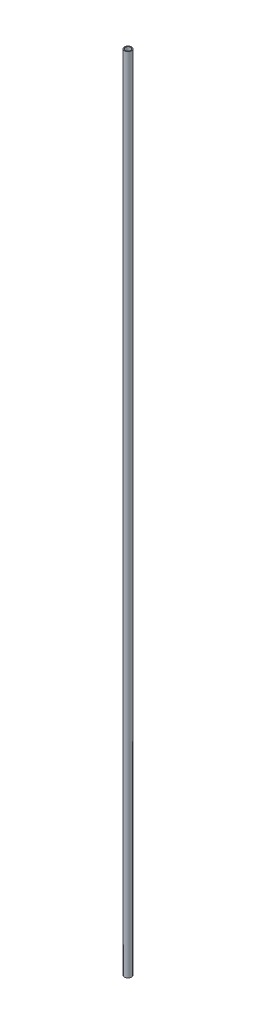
ISO-10303-21;
HEADER;
FILE_DESCRIPTION(('STEP AP214'),'2;1');
FILE_NAME('part.step','',(''),(''),'','','');
FILE_SCHEMA(('AUTOMOTIVE_DESIGN { 1 0 10303 214 1 1 1 1 }'));
ENDSEC;
DATA;
#1=APPLICATION_CONTEXT('core data for automotive mechanical design processes');
#2=APPLICATION_PROTOCOL_DEFINITION('international standard','automotive_design',2000,#1);
#3=PRODUCT_CONTEXT('',#1,'mechanical');
#4=PRODUCT('Part','Part','',(#3));
#5=PRODUCT_RELATED_PRODUCT_CATEGORY('part','',(#4));
#6=PRODUCT_DEFINITION_FORMATION('','',#4);
#7=PRODUCT_DEFINITION_CONTEXT('part definition',#1,'design');
#8=PRODUCT_DEFINITION('design','',#6,#7);
#9=PRODUCT_DEFINITION_SHAPE('','',#8);
#10=(LENGTH_UNIT() NAMED_UNIT(*) SI_UNIT(.MILLI.,.METRE.));
#11=(NAMED_UNIT(*) PLANE_ANGLE_UNIT() SI_UNIT($,.RADIAN.));
#12=(NAMED_UNIT(*) SI_UNIT($,.STERADIAN.) SOLID_ANGLE_UNIT());
#13=UNCERTAINTY_MEASURE_WITH_UNIT(LENGTH_MEASURE(1.E-05),#10,'distance_accuracy_value','');
#14=(GEOMETRIC_REPRESENTATION_CONTEXT(3) GLOBAL_UNCERTAINTY_ASSIGNED_CONTEXT((#13)) GLOBAL_UNIT_ASSIGNED_CONTEXT((#10,
#11,#12)) REPRESENTATION_CONTEXT('',''));
#15=CARTESIAN_POINT('',(0.,0.,0.));
#16=DIRECTION('',(0.,0.,1.));
#17=DIRECTION('',(1.,0.,0.));
#18=AXIS2_PLACEMENT_3D('',#15,#16,#17);
#19=CARTESIAN_POINT('',(0.,3048.,0.));
#20=DIRECTION('',(0.,1.,0.));
#21=DIRECTION('',(0.,0.,1.));
#22=AXIS2_PLACEMENT_3D('',#19,#20,#21);
#23=PLANE('',#22);
#24=CARTESIAN_POINT('',(0.,3048.,0.));
#25=DIRECTION('',(0.,1.,0.));
#26=DIRECTION('',(0.,0.,1.));
#27=AXIS2_PLACEMENT_3D('',#24,#25,#26);
#28=CIRCLE('',#27,13.335);
#29=CARTESIAN_POINT('',(0.,3048.,13.335));
#30=VERTEX_POINT('',#29);
#31=EDGE_CURVE('E10',#30,#30,#28,.T.);
#32=ORIENTED_EDGE('',*,*,#31,.T.);
#33=EDGE_LOOP('',(#32));
#34=FACE_BOUND('',#33,.T.);
#35=CARTESIAN_POINT('',(0.,3048.,0.));
#36=DIRECTION('',(0.,1.,0.));
#37=DIRECTION('',(0.,0.,1.));
#38=AXIS2_PLACEMENT_3D('',#35,#36,#37);
#39=CIRCLE('',#38,10.2108);
#40=CARTESIAN_POINT('',(0.,3048.,10.2108));
#41=VERTEX_POINT('',#40);
#42=EDGE_CURVE('E56',#41,#41,#39,.T.);
#43=ORIENTED_EDGE('',*,*,#42,.F.);
#44=EDGE_LOOP('',(#43));
#45=FACE_BOUND('',#44,.T.);
#46=ADVANCED_FACE('F43',(#34,#45),#23,.T.);
#47=CARTESIAN_POINT('',(0.,0.,0.));
#48=DIRECTION('',(0.,1.,0.));
#49=DIRECTION('',(0.,0.,1.));
#50=AXIS2_PLACEMENT_3D('',#47,#48,#49);
#51=PLANE('',#50);
#52=CARTESIAN_POINT('',(0.,0.,0.));
#53=DIRECTION('',(0.,1.,0.));
#54=DIRECTION('',(0.,0.,1.));
#55=AXIS2_PLACEMENT_3D('',#52,#53,#54);
#56=CIRCLE('',#55,13.335);
#57=CARTESIAN_POINT('',(0.,0.,13.335));
#58=VERTEX_POINT('',#57);
#59=EDGE_CURVE('E47',#58,#58,#56,.T.);
#60=ORIENTED_EDGE('',*,*,#59,.F.);
#61=EDGE_LOOP('',(#60));
#62=FACE_BOUND('',#61,.T.);
#63=CARTESIAN_POINT('',(0.,0.,0.));
#64=DIRECTION('',(0.,1.,0.));
#65=DIRECTION('',(0.,0.,1.));
#66=AXIS2_PLACEMENT_3D('',#63,#64,#65);
#67=CIRCLE('',#66,10.2108);
#68=CARTESIAN_POINT('',(0.,0.,10.2108));
#69=VERTEX_POINT('',#68);
#70=EDGE_CURVE('E58',#69,#69,#67,.T.);
#71=ORIENTED_EDGE('',*,*,#70,.T.);
#72=EDGE_LOOP('',(#71));
#73=FACE_BOUND('',#72,.T.);
#74=ADVANCED_FACE('F70',(#62,#73),#51,.F.);
#75=CARTESIAN_POINT('',(0.,3048.,0.));
#76=DIRECTION('',(0.,-1.,0.));
#77=DIRECTION('',(0.,0.,-1.));
#78=AXIS2_PLACEMENT_3D('',#75,#76,#77);
#79=CYLINDRICAL_SURFACE('',#78,13.335);
#80=ORIENTED_EDGE('',*,*,#31,.F.);
#81=EDGE_LOOP('',(#80));
#82=FACE_BOUND('',#81,.T.);
#83=ORIENTED_EDGE('',*,*,#59,.T.);
#84=EDGE_LOOP('',(#83));
#85=FACE_BOUND('',#84,.T.);
#86=ADVANCED_FACE('F45',(#82,#85),#79,.T.);
#87=CARTESIAN_POINT('',(0.,3048.,0.));
#88=DIRECTION('',(0.,-1.,0.));
#89=DIRECTION('',(0.,0.,-1.));
#90=AXIS2_PLACEMENT_3D('',#87,#88,#89);
#91=CYLINDRICAL_SURFACE('',#90,10.2108);
#92=ORIENTED_EDGE('',*,*,#42,.T.);
#93=EDGE_LOOP('',(#92));
#94=FACE_BOUND('',#93,.T.);
#95=ORIENTED_EDGE('',*,*,#70,.F.);
#96=EDGE_LOOP('',(#95));
#97=FACE_BOUND('',#96,.T.);
#98=ADVANCED_FACE('F66',(#94,#97),#91,.F.);
#99=CLOSED_SHELL('',(#46,#74,#86,#98));
#100=MANIFOLD_SOLID_BREP('B2',#99);
#101=ADVANCED_BREP_SHAPE_REPRESENTATION('',(#18,#100),#14);
#102=SHAPE_DEFINITION_REPRESENTATION(#9,#101);
ENDSEC;
END-ISO-10303-21;
